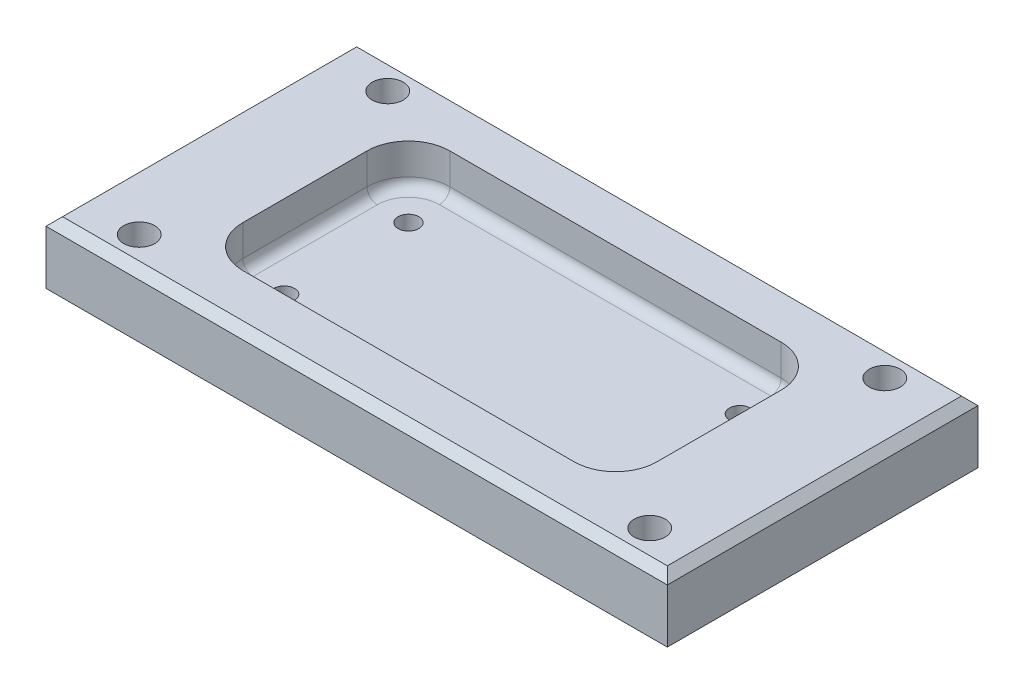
from build123d import *

# Parameters (mm, degrees)
SKETCH1_W          = 150
SKETCH1_H          = 75
BASE_FEATURE_DEPTH = 15
SKETCH2_W          = 100
SKETCH2_H          = 50
POCKET_DEPTH       = 10
SKETCH3_R          = 3.75
D6_HOLE_DEPTH      = 86.183625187
FILLET_R10_R       = 10
SKETCH4_R          = 2.5
D5_HOLE_DEPTH      = 10
FILLET_R2_5_R      = 2.5
CHAMFER_2_SIZE     = 2


with BuildPart() as part:
    # Sketch1 → Base Feature (new body)
    with BuildSketch(Plane(origin=(0, 0, 0), x_dir=(1, 0, 0), z_dir=(0, 1, 0))):
        Rectangle(SKETCH1_W, SKETCH1_H)
    extrude(amount=BASE_FEATURE_DEPTH)

    # Sketch2 → Pocket (cut)
    with BuildSketch(Plane(origin=(0, 15, 0), x_dir=(1, 0, 0), z_dir=(0, 1, 0))):
        Rectangle(SKETCH2_W, SKETCH2_H)
    extrude(amount=-POCKET_DEPTH, mode=Mode.SUBTRACT)

    # Sketch3 → D6 Hole (cut, through all)
    with BuildSketch(Plane(origin=(0, 15, 0), x_dir=(1, 0, 0), z_dir=(0, 1, 0))):
        with Locations(Location((-60, 30, 0), (0, 0, 270))):
            Circle(SKETCH3_R)
        with Locations(Location((-60, -30, 0), (0, 0, 270))):
            Circle(SKETCH3_R)
        with Locations(Location((60, 30, 0), (0, 0, 270))):
            Circle(SKETCH3_R)
        with Locations(Location((62.982385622, -29.735586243, 0), (0, 0, 270))):
            Circle(SKETCH3_R)
    extrude(amount=-D6_HOLE_DEPTH, mode=Mode.SUBTRACT)

    # Fillet R10
    fillet_r10_edges = [part.edges().sort_by_distance(p)[0] for p in [
        (50, 10, -25),
        (50, 10, 25),
        (-50, 10, 25),
        (-50, 10, -25),
    ]]
    fillet(fillet_r10_edges, radius=FILLET_R10_R)

    # Sketch4 → D5 Hole (cut)
    with BuildSketch(Plane(origin=(0, 5, 0), x_dir=(1, 0, 0), z_dir=(0, 1, 0))):
        with Locations(Location((-40, 15, 0), (0, 0, 270))):
            Circle(SKETCH4_R)
        with Locations(Location((-40, -15, 0), (0, 0, 270))):
            Circle(SKETCH4_R)
        with Locations(Location((40, 15, 0), (0, 0, 270))):
            Circle(SKETCH4_R)
        with Locations(Location((40, -15, 0), (0, 0, 270))):
            Circle(SKETCH4_R)
    extrude(amount=-D5_HOLE_DEPTH, mode=Mode.SUBTRACT)

    # Fillet R2.5
    fillet_r2_5_edges = [part.edges().sort_by_distance(p)[0] for p in [
        (0, 5, 25),
        (-50, 5, 0),
        (50, 5, 0),
        (0, 5, -25),
        (-47.071067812, 5, -22.071067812),
        (47.071067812, 5, -22.071067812),
        (47.071067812, 5, 22.071067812),
        (-47.071067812, 5, 22.071067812),
    ]]
    fillet(fillet_r2_5_edges, radius=FILLET_R2_5_R)

    # Chamfer 2
    chamfer_2_edges = [part.edges().sort_by_distance(p)[0] for p in [
        (-75, 15, 0),
        (0, 15, 37.5),
        (75, 15, 0),
        (0, 15, -37.5),
    ]]
    chamfer(chamfer_2_edges, length=CHAMFER_2_SIZE)


solid = part.part
